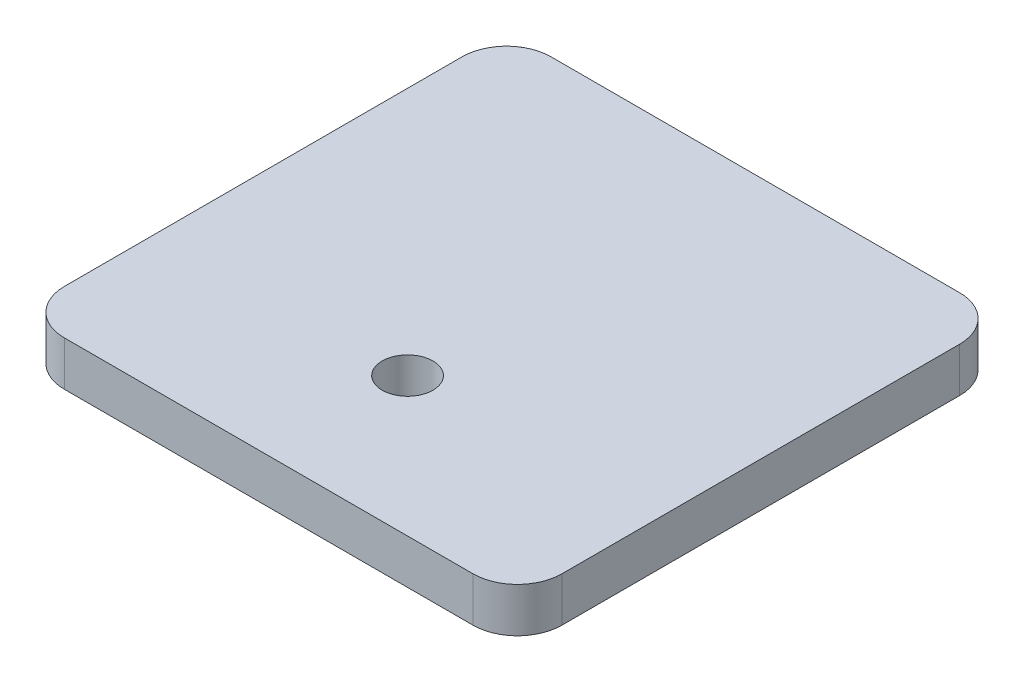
ISO-10303-21;
HEADER;
FILE_DESCRIPTION(('STEP AP214'),'2;1');
FILE_NAME('part.step','',(''),(''),'','','');
FILE_SCHEMA(('AUTOMOTIVE_DESIGN { 1 0 10303 214 1 1 1 1 }'));
ENDSEC;
DATA;
#1=APPLICATION_CONTEXT('core data for automotive mechanical design processes');
#2=APPLICATION_PROTOCOL_DEFINITION('international standard','automotive_design',2000,#1);
#3=PRODUCT_CONTEXT('',#1,'mechanical');
#4=PRODUCT('Part','Part','',(#3));
#5=PRODUCT_RELATED_PRODUCT_CATEGORY('part','',(#4));
#6=PRODUCT_DEFINITION_FORMATION('','',#4);
#7=PRODUCT_DEFINITION_CONTEXT('part definition',#1,'design');
#8=PRODUCT_DEFINITION('design','',#6,#7);
#9=PRODUCT_DEFINITION_SHAPE('','',#8);
#10=(LENGTH_UNIT() NAMED_UNIT(*) SI_UNIT(.MILLI.,.METRE.));
#11=(NAMED_UNIT(*) PLANE_ANGLE_UNIT() SI_UNIT($,.RADIAN.));
#12=(NAMED_UNIT(*) SI_UNIT($,.STERADIAN.) SOLID_ANGLE_UNIT());
#13=UNCERTAINTY_MEASURE_WITH_UNIT(LENGTH_MEASURE(1.E-05),#10,'distance_accuracy_value','');
#14=(GEOMETRIC_REPRESENTATION_CONTEXT(3) GLOBAL_UNCERTAINTY_ASSIGNED_CONTEXT((#13)) GLOBAL_UNIT_ASSIGNED_CONTEXT((#10,
#11,#12)) REPRESENTATION_CONTEXT('',''));
#15=CARTESIAN_POINT('',(0.,0.,0.));
#16=DIRECTION('',(0.,0.,1.));
#17=DIRECTION('',(1.,0.,0.));
#18=AXIS2_PLACEMENT_3D('',#15,#16,#17);
#19=CARTESIAN_POINT('',(16.2,3.,-93.9372583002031));
#20=DIRECTION('',(1.,0.,0.));
#21=DIRECTION('',(0.,0.,-1.));
#22=AXIS2_PLACEMENT_3D('',#19,#20,#21);
#23=PLANE('',#22);
#24=DIRECTION('',(0.,0.,1.));
#25=VECTOR('',#24,1.);
#26=CARTESIAN_POINT('',(16.2,3.,-93.9372583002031));
#27=LINE('',#26,#25);
#28=CARTESIAN_POINT('',(16.2,3.,-53.672155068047));
#29=VERTEX_POINT('',#28);
#30=CARTESIAN_POINT('',(16.1999999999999,3.,-16.2));
#31=VERTEX_POINT('',#30);
#32=EDGE_CURVE('E284',#29,#31,#27,.T.);
#33=ORIENTED_EDGE('',*,*,#32,.F.);
#34=DIRECTION('',(0.,-1.,0.));
#35=VECTOR('',#34,1.);
#36=CARTESIAN_POINT('',(16.2,8.2,-53.672155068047));
#37=LINE('',#36,#35);
#38=CARTESIAN_POINT('',(16.2,0.,-53.672155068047));
#39=VERTEX_POINT('',#38);
#40=EDGE_CURVE('E466',#29,#39,#37,.T.);
#41=ORIENTED_EDGE('',*,*,#40,.T.);
#42=DIRECTION('',(0.,0.,1.));
#43=VECTOR('',#42,1.);
#44=CARTESIAN_POINT('',(16.2,0.,-93.9372583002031));
#45=LINE('',#44,#43);
#46=CARTESIAN_POINT('',(16.1999999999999,0.,-16.2));
#47=VERTEX_POINT('',#46);
#48=EDGE_CURVE('E230',#39,#47,#45,.T.);
#49=ORIENTED_EDGE('',*,*,#48,.T.);
#50=DIRECTION('',(0.,-1.,0.));
#51=VECTOR('',#50,1.);
#52=CARTESIAN_POINT('',(16.1999999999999,3.,-16.2));
#53=LINE('',#52,#51);
#54=EDGE_CURVE('E311',#31,#47,#53,.T.);
#55=ORIENTED_EDGE('',*,*,#54,.F.);
#56=EDGE_LOOP('',(#33,#41,#49,#55));
#57=FACE_BOUND('',#56,.T.);
#58=ADVANCED_FACE('F17',(#57),#23,.F.);
#59=CARTESIAN_POINT('',(10.,3.,-12.3900209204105));
#60=DIRECTION('',(-1.,0.,0.));
#61=DIRECTION('',(0.,0.,1.));
#62=AXIS2_PLACEMENT_3D('',#59,#60,#61);
#63=PLANE('',#62);
#64=DIRECTION('',(0.,0.,-1.));
#65=VECTOR('',#64,1.);
#66=CARTESIAN_POINT('',(10.,3.,-12.3900209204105));
#67=LINE('',#66,#65);
#68=CARTESIAN_POINT('',(10.,3.,-58.7278449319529));
#69=VERTEX_POINT('',#68);
#70=CARTESIAN_POINT('',(10.,3.,-93.9372583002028));
#71=VERTEX_POINT('',#70);
#72=EDGE_CURVE('E271',#69,#71,#67,.T.);
#73=ORIENTED_EDGE('',*,*,#72,.F.);
#74=DIRECTION('',(0.,-1.,0.));
#75=VECTOR('',#74,1.);
#76=CARTESIAN_POINT('',(10.,8.2,-58.7278449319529));
#77=LINE('',#76,#75);
#78=CARTESIAN_POINT('',(10.,0.,-58.7278449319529));
#79=VERTEX_POINT('',#78);
#80=EDGE_CURVE('E32',#69,#79,#77,.T.);
#81=ORIENTED_EDGE('',*,*,#80,.T.);
#82=DIRECTION('',(0.,0.,-1.));
#83=VECTOR('',#82,1.);
#84=CARTESIAN_POINT('',(10.,0.,-12.3900209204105));
#85=LINE('',#84,#83);
#86=CARTESIAN_POINT('',(10.,0.,-93.9372583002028));
#87=VERTEX_POINT('',#86);
#88=EDGE_CURVE('E433',#79,#87,#85,.T.);
#89=ORIENTED_EDGE('',*,*,#88,.T.);
#90=DIRECTION('',(0.,-1.,0.));
#91=VECTOR('',#90,1.);
#92=CARTESIAN_POINT('',(10.,3.,-93.9372583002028));
#93=LINE('',#92,#91);
#94=EDGE_CURVE('E319',#71,#87,#93,.T.);
#95=ORIENTED_EDGE('',*,*,#94,.F.);
#96=EDGE_LOOP('',(#73,#81,#89,#95));
#97=FACE_BOUND('',#96,.T.);
#98=ADVANCED_FACE('F459',(#97),#63,.F.);
#99=CARTESIAN_POINT('',(100.618629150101,3.,-41.5186291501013));
#100=DIRECTION('',(0.,-1.,0.));
#101=DIRECTION('',(0.,0.,-1.));
#102=AXIS2_PLACEMENT_3D('',#99,#100,#101);
#103=PLANE('',#102);
#104=CARTESIAN_POINT('',(13.1,3.,-56.2));
#105=DIRECTION('',(0.,-1.,0.));
#106=DIRECTION('',(0.,0.,-1.));
#107=AXIS2_PLACEMENT_3D('',#104,#105,#106);
#108=CIRCLE('',#107,4.);
#109=CARTESIAN_POINT('',(10.,3.,-53.6721550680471));
#110=VERTEX_POINT('',#109);
#111=EDGE_CURVE('E11',#29,#110,#108,.T.);
#112=ORIENTED_EDGE('',*,*,#111,.F.);
#113=ORIENTED_EDGE('',*,*,#32,.T.);
#114=DIRECTION('',(1.,0.,0.));
#115=VECTOR('',#114,1.);
#116=CARTESIAN_POINT('',(16.1999999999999,3.,-16.2));
#117=LINE('',#116,#115);
#118=CARTESIAN_POINT('',(53.347155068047,3.,-16.2));
#119=VERTEX_POINT('',#118);
#120=EDGE_CURVE('E288',#31,#119,#117,.T.);
#121=ORIENTED_EDGE('',*,*,#120,.T.);
#122=CARTESIAN_POINT('',(55.875,3.,-13.1));
#123=DIRECTION('',(0.,-1.,0.));
#124=DIRECTION('',(0.,0.,-1.));
#125=AXIS2_PLACEMENT_3D('',#122,#123,#124);
#126=CIRCLE('',#125,4.00000000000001);
#127=CARTESIAN_POINT('',(53.347155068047,3.,-10.));
#128=VERTEX_POINT('',#127);
#129=EDGE_CURVE('E395',#128,#119,#126,.T.);
#130=ORIENTED_EDGE('',*,*,#129,.F.);
#131=DIRECTION('',(-1.,0.,0.));
#132=VECTOR('',#131,1.);
#133=CARTESIAN_POINT('',(99.4872583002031,3.,-10.));
#134=LINE('',#133,#132);
#135=CARTESIAN_POINT('',(12.3900209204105,3.,-10.));
#136=VERTEX_POINT('',#135);
#137=EDGE_CURVE('E264',#128,#136,#134,.T.);
#138=ORIENTED_EDGE('',*,*,#137,.T.);
#139=CARTESIAN_POINT('',(11.1950104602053,3.,-11.1950104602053));
#140=DIRECTION('',(0.,-1.,0.));
#141=DIRECTION('',(0.,0.,-1.));
#142=AXIS2_PLACEMENT_3D('',#139,#140,#141);
#143=CIRCLE('',#142,1.69);
#144=CARTESIAN_POINT('',(10.,3.,-12.3900209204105));
#145=VERTEX_POINT('',#144);
#146=EDGE_CURVE('E268',#136,#145,#143,.T.);
#147=ORIENTED_EDGE('',*,*,#146,.T.);
#148=EDGE_CURVE('E272',#145,#110,#67,.T.);
#149=ORIENTED_EDGE('',*,*,#148,.T.);
#150=EDGE_LOOP('',(#112,#113,#121,#130,#138,#147,#149));
#151=FACE_BOUND('',#150,.T.);
#152=ADVANCED_FACE('F526',(#151),#103,.T.);
#153=CARTESIAN_POINT('',(16.1999999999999,3.,-16.2));
#154=DIRECTION('',(0.,0.,-1.));
#155=DIRECTION('',(-1.,0.,0.));
#156=AXIS2_PLACEMENT_3D('',#153,#154,#155);
#157=PLANE('',#156);
#158=CARTESIAN_POINT('',(58.4028449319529,3.,-16.2));
#159=VERTEX_POINT('',#158);
#160=CARTESIAN_POINT('',(95.55,3.,-16.2));
#161=VERTEX_POINT('',#160);
#162=EDGE_CURVE('E287',#159,#161,#117,.T.);
#163=ORIENTED_EDGE('',*,*,#162,.F.);
#164=DIRECTION('',(0.,-1.,0.));
#165=VECTOR('',#164,1.);
#166=CARTESIAN_POINT('',(58.4028449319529,8.2,-16.2));
#167=LINE('',#166,#165);
#168=CARTESIAN_POINT('',(58.4028449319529,0.,-16.2));
#169=VERTEX_POINT('',#168);
#170=EDGE_CURVE('E404',#159,#169,#167,.T.);
#171=ORIENTED_EDGE('',*,*,#170,.T.);
#172=DIRECTION('',(1.,0.,0.));
#173=VECTOR('',#172,1.);
#174=CARTESIAN_POINT('',(16.1999999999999,0.,-16.2));
#175=LINE('',#174,#173);
#176=CARTESIAN_POINT('',(95.55,0.,-16.2));
#177=VERTEX_POINT('',#176);
#178=EDGE_CURVE('E237',#169,#177,#175,.T.);
#179=ORIENTED_EDGE('',*,*,#178,.T.);
#180=DIRECTION('',(0.,-1.,0.));
#181=VECTOR('',#180,1.);
#182=CARTESIAN_POINT('',(95.55,3.,-16.2));
#183=LINE('',#182,#181);
#184=EDGE_CURVE('E308',#161,#177,#183,.T.);
#185=ORIENTED_EDGE('',*,*,#184,.F.);
#186=EDGE_LOOP('',(#163,#171,#179,#185));
#187=FACE_BOUND('',#186,.T.);
#188=ADVANCED_FACE('F523',(#187),#157,.F.);
#189=CARTESIAN_POINT('',(99.4872583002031,3.,-10.));
#190=DIRECTION('',(0.,0.,1.));
#191=DIRECTION('',(1.,0.,0.));
#192=AXIS2_PLACEMENT_3D('',#189,#190,#191);
#193=PLANE('',#192);
#194=ORIENTED_EDGE('',*,*,#137,.F.);
#195=DIRECTION('',(0.,-1.,0.));
#196=VECTOR('',#195,1.);
#197=CARTESIAN_POINT('',(53.347155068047,8.2,-10.));
#198=LINE('',#197,#196);
#199=CARTESIAN_POINT('',(53.347155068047,0.,-10.));
#200=VERTEX_POINT('',#199);
#201=EDGE_CURVE('E40',#128,#200,#198,.T.);
#202=ORIENTED_EDGE('',*,*,#201,.T.);
#203=DIRECTION('',(-1.,0.,0.));
#204=VECTOR('',#203,1.);
#205=CARTESIAN_POINT('',(99.4872583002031,0.,-10.));
#206=LINE('',#205,#204);
#207=CARTESIAN_POINT('',(12.3900209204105,0.,-10.));
#208=VERTEX_POINT('',#207);
#209=EDGE_CURVE('E425',#200,#208,#206,.T.);
#210=ORIENTED_EDGE('',*,*,#209,.T.);
#211=DIRECTION('',(0.,-1.,0.));
#212=VECTOR('',#211,1.);
#213=CARTESIAN_POINT('',(12.3900209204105,3.,-10.));
#214=LINE('',#213,#212);
#215=EDGE_CURVE('E324',#136,#208,#214,.T.);
#216=ORIENTED_EDGE('',*,*,#215,.F.);
#217=EDGE_LOOP('',(#194,#202,#210,#216));
#218=FACE_BOUND('',#217,.T.);
#219=ADVANCED_FACE('F525',(#218),#193,.F.);
#220=CARTESIAN_POINT('',(58.4028449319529,3.,-10.));
#221=VERTEX_POINT('',#220);
#222=EDGE_CURVE('E396',#159,#221,#126,.T.);
#223=ORIENTED_EDGE('',*,*,#222,.F.);
#224=ORIENTED_EDGE('',*,*,#162,.T.);
#225=DIRECTION('',(0.,0.,-1.));
#226=VECTOR('',#225,1.);
#227=CARTESIAN_POINT('',(95.55,3.,-16.2));
#228=LINE('',#227,#226);
#229=CARTESIAN_POINT('',(95.55,3.,-40.387258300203));
#230=VERTEX_POINT('',#229);
#231=EDGE_CURVE('E291',#161,#230,#228,.T.);
#232=ORIENTED_EDGE('',*,*,#231,.T.);
#233=CARTESIAN_POINT('',(96.6813708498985,3.,-41.5186291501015));
#234=DIRECTION('',(0.,-1.,0.));
#235=DIRECTION('',(0.,0.,1.));
#236=AXIS2_PLACEMENT_3D('',#233,#234,#235);
#237=CIRCLE('',#236,1.60000000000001);
#238=CARTESIAN_POINT('',(97.812741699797,3.,-42.65));
#239=VERTEX_POINT('',#238);
#240=EDGE_CURVE('E294',#230,#239,#237,.T.);
#241=ORIENTED_EDGE('',*,*,#240,.T.);
#242=DIRECTION('',(1.,0.,0.));
#243=VECTOR('',#242,1.);
#244=CARTESIAN_POINT('',(97.812741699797,3.,-42.65));
#245=LINE('',#244,#243);
#246=CARTESIAN_POINT('',(99.487258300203,3.,-42.65));
#247=VERTEX_POINT('',#246);
#248=EDGE_CURVE('E297',#239,#247,#245,.T.);
#249=ORIENTED_EDGE('',*,*,#248,.T.);
#250=CARTESIAN_POINT('',(100.618629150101,3.,-41.5186291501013));
#251=DIRECTION('',(0.,-1.,0.));
#252=DIRECTION('',(0.,0.,-1.));
#253=AXIS2_PLACEMENT_3D('',#250,#251,#252);
#254=CIRCLE('',#253,1.60000000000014);
#255=CARTESIAN_POINT('',(101.75,3.,-40.3872583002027));
#256=VERTEX_POINT('',#255);
#257=EDGE_CURVE('E255',#247,#256,#254,.T.);
#258=ORIENTED_EDGE('',*,*,#257,.T.);
#259=DIRECTION('',(0.,0.,1.));
#260=VECTOR('',#259,1.);
#261=CARTESIAN_POINT('',(101.75,3.,-40.3872583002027));
#262=LINE('',#261,#260);
#263=CARTESIAN_POINT('',(101.75,3.,-12.2627416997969));
#264=VERTEX_POINT('',#263);
#265=EDGE_CURVE('E258',#256,#264,#262,.T.);
#266=ORIENTED_EDGE('',*,*,#265,.T.);
#267=CARTESIAN_POINT('',(100.618629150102,3.,-11.1313708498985));
#268=DIRECTION('',(0.,-1.,0.));
#269=DIRECTION('',(0.,0.,-1.));
#270=AXIS2_PLACEMENT_3D('',#267,#268,#269);
#271=CIRCLE('',#270,1.59999999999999);
#272=CARTESIAN_POINT('',(99.4872583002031,3.,-10.));
#273=VERTEX_POINT('',#272);
#274=EDGE_CURVE('E261',#264,#273,#271,.T.);
#275=ORIENTED_EDGE('',*,*,#274,.T.);
#276=EDGE_CURVE('E265',#273,#221,#134,.T.);
#277=ORIENTED_EDGE('',*,*,#276,.T.);
#278=EDGE_LOOP('',(#223,#224,#232,#241,#249,#258,#266,#275,#277));
#279=FACE_BOUND('',#278,.T.);
#280=ADVANCED_FACE('F415',(#279),#103,.T.);
#281=CARTESIAN_POINT('',(101.75,10.,-10.));
#282=DIRECTION('',(0.,1.,0.));
#283=DIRECTION('',(0.,0.,1.));
#284=AXIS2_PLACEMENT_3D('',#281,#282,#283);
#285=PLANE('',#284);
#286=CARTESIAN_POINT('',(101.75,10.,-10.));
#287=DIRECTION('',(0.,1.,0.));
#288=DIRECTION('',(0.,0.,1.));
#289=AXIS2_PLACEMENT_3D('',#286,#287,#288);
#290=CIRCLE('',#289,10.);
#291=CARTESIAN_POINT('',(101.75,10.,0.));
#292=VERTEX_POINT('',#291);
#293=CARTESIAN_POINT('',(111.75,10.,-10.0000000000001));
#294=VERTEX_POINT('',#293);
#295=EDGE_CURVE('E355',#292,#294,#290,.T.);
#296=ORIENTED_EDGE('',*,*,#295,.T.);
#297=DIRECTION('',(0.,0.,-1.));
#298=VECTOR('',#297,1.);
#299=CARTESIAN_POINT('',(111.75,10.,-10.0000000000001));
#300=LINE('',#299,#298);
#301=CARTESIAN_POINT('',(111.75,10.,-99.2999999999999));
#302=VERTEX_POINT('',#301);
#303=EDGE_CURVE('E358',#294,#302,#300,.T.);
#304=ORIENTED_EDGE('',*,*,#303,.T.);
#305=CARTESIAN_POINT('',(101.75,10.,-99.3));
#306=DIRECTION('',(0.,1.,0.));
#307=DIRECTION('',(0.,0.,-1.));
#308=AXIS2_PLACEMENT_3D('',#305,#306,#307);
#309=CIRCLE('',#308,9.99999999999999);
#310=CARTESIAN_POINT('',(101.75,10.,-109.3));
#311=VERTEX_POINT('',#310);
#312=EDGE_CURVE('E360',#302,#311,#309,.T.);
#313=ORIENTED_EDGE('',*,*,#312,.T.);
#314=DIRECTION('',(-1.,0.,0.));
#315=VECTOR('',#314,1.);
#316=CARTESIAN_POINT('',(10.0000000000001,10.,-109.3));
#317=LINE('',#316,#315);
#318=CARTESIAN_POINT('',(10.0000000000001,10.,-109.3));
#319=VERTEX_POINT('',#318);
#320=EDGE_CURVE('E362',#311,#319,#317,.T.);
#321=ORIENTED_EDGE('',*,*,#320,.T.);
#322=CARTESIAN_POINT('',(10.,10.,-99.3));
#323=DIRECTION('',(0.,1.,0.));
#324=DIRECTION('',(0.,0.,-1.));
#325=AXIS2_PLACEMENT_3D('',#322,#323,#324);
#326=CIRCLE('',#325,10.);
#327=CARTESIAN_POINT('',(0.,10.,-99.2999999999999));
#328=VERTEX_POINT('',#327);
#329=EDGE_CURVE('E364',#319,#328,#326,.T.);
#330=ORIENTED_EDGE('',*,*,#329,.T.);
#331=DIRECTION('',(0.,0.,1.));
#332=VECTOR('',#331,1.);
#333=CARTESIAN_POINT('',(0.,10.,-10.0000000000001));
#334=LINE('',#333,#332);
#335=CARTESIAN_POINT('',(0.,10.,-10.0000000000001));
#336=VERTEX_POINT('',#335);
#337=EDGE_CURVE('E366',#328,#336,#334,.T.);
#338=ORIENTED_EDGE('',*,*,#337,.T.);
#339=CARTESIAN_POINT('',(10.,10.,-10.));
#340=DIRECTION('',(0.,1.,0.));
#341=DIRECTION('',(0.,0.,-1.));
#342=AXIS2_PLACEMENT_3D('',#339,#340,#341);
#343=CIRCLE('',#342,10.);
#344=CARTESIAN_POINT('',(10.0000000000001,10.,0.));
#345=VERTEX_POINT('',#344);
#346=EDGE_CURVE('E368',#336,#345,#343,.T.);
#347=ORIENTED_EDGE('',*,*,#346,.T.);
#348=DIRECTION('',(1.,0.,0.));
#349=VECTOR('',#348,1.);
#350=CARTESIAN_POINT('',(10.0000000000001,10.,0.));
#351=LINE('',#350,#349);
#352=EDGE_CURVE('E370',#345,#292,#351,.T.);
#353=ORIENTED_EDGE('',*,*,#352,.T.);
#354=EDGE_LOOP('',(#296,#304,#313,#321,#330,#338,#347,#353));
#355=FACE_BOUND('',#354,.T.);
#356=CARTESIAN_POINT('',(55.875,10.,-31.2));
#357=DIRECTION('',(0.,1.,0.));
#358=DIRECTION('',(0.,0.,1.));
#359=AXIS2_PLACEMENT_3D('',#356,#357,#358);
#360=CIRCLE('',#359,5.70000000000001);
#361=CARTESIAN_POINT('',(55.875,10.,-25.5));
#362=VERTEX_POINT('',#361);
#363=EDGE_CURVE('E335',#362,#362,#360,.T.);
#364=ORIENTED_EDGE('',*,*,#363,.F.);
#365=EDGE_LOOP('',(#364));
#366=FACE_BOUND('',#365,.T.);
#367=ADVANCED_FACE('F588',(#355,#366),#285,.T.);
#368=CARTESIAN_POINT('',(101.75,0.,-10.));
#369=DIRECTION('',(0.,1.,0.));
#370=DIRECTION('',(0.,0.,1.));
#371=AXIS2_PLACEMENT_3D('',#368,#369,#370);
#372=PLANE('',#371);
#373=CARTESIAN_POINT('',(66.9386396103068,0.,-82.7439628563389));
#374=DIRECTION('',(0.,-1.,0.));
#375=DIRECTION('',(0.,0.,1.));
#376=AXIS2_PLACEMENT_3D('',#373,#374,#375);
#377=CIRCLE('',#376,1.1);
#378=CARTESIAN_POINT('',(66.9386396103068,0.,-81.6439628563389));
#379=VERTEX_POINT('',#378);
#380=EDGE_CURVE('E476',#379,#379,#377,.T.);
#381=ORIENTED_EDGE('',*,*,#380,.F.);
#382=EDGE_LOOP('',(#381));
#383=FACE_BOUND('',#382,.T.);
#384=CARTESIAN_POINT('',(44.9386396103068,0.,-82.7439628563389));
#385=DIRECTION('',(0.,-1.,0.));
#386=DIRECTION('',(0.,0.,-1.));
#387=AXIS2_PLACEMENT_3D('',#384,#385,#386);
#388=CIRCLE('',#387,1.1);
#389=CARTESIAN_POINT('',(44.9386396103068,0.,-83.8439628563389));
#390=VERTEX_POINT('',#389);
#391=EDGE_CURVE('E482',#390,#390,#388,.T.);
#392=ORIENTED_EDGE('',*,*,#391,.F.);
#393=EDGE_LOOP('',(#392));
#394=FACE_BOUND('',#393,.T.);
#395=CARTESIAN_POINT('',(44.9386396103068,0.,-36.7439628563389));
#396=DIRECTION('',(0.,-1.,0.));
#397=DIRECTION('',(0.,0.,1.));
#398=AXIS2_PLACEMENT_3D('',#395,#396,#397);
#399=CIRCLE('',#398,1.10000000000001);
#400=CARTESIAN_POINT('',(44.9386396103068,0.,-35.6439628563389));
#401=VERTEX_POINT('',#400);
#402=EDGE_CURVE('E488',#401,#401,#399,.T.);
#403=ORIENTED_EDGE('',*,*,#402,.F.);
#404=EDGE_LOOP('',(#403));
#405=FACE_BOUND('',#404,.T.);
#406=CARTESIAN_POINT('',(66.9386396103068,0.,-36.7439628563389));
#407=DIRECTION('',(0.,-1.,0.));
#408=DIRECTION('',(0.,0.,-1.));
#409=AXIS2_PLACEMENT_3D('',#406,#407,#408);
#410=CIRCLE('',#409,1.10000000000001);
#411=CARTESIAN_POINT('',(66.9386396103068,0.,-37.8439628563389));
#412=VERTEX_POINT('',#411);
#413=EDGE_CURVE('E494',#412,#412,#410,.T.);
#414=ORIENTED_EDGE('',*,*,#413,.F.);
#415=EDGE_LOOP('',(#414));
#416=FACE_BOUND('',#415,.T.);
#417=ORIENTED_EDGE('',*,*,#48,.F.);
#418=CARTESIAN_POINT('',(13.1,0.,-56.2));
#419=DIRECTION('',(0.,-1.,0.));
#420=DIRECTION('',(0.,0.,-1.));
#421=AXIS2_PLACEMENT_3D('',#418,#419,#420);
#422=CIRCLE('',#421,4.);
#423=CARTESIAN_POINT('',(16.2,0.,-58.727844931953));
#424=VERTEX_POINT('',#423);
#425=EDGE_CURVE('E214',#424,#39,#422,.T.);
#426=ORIENTED_EDGE('',*,*,#425,.F.);
#427=CARTESIAN_POINT('',(16.2,0.,-93.9372583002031));
#428=VERTEX_POINT('',#427);
#429=EDGE_CURVE('E228',#428,#424,#45,.T.);
#430=ORIENTED_EDGE('',*,*,#429,.F.);
#431=CARTESIAN_POINT('',(15.0686291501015,0.,-95.0686291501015));
#432=DIRECTION('',(0.,-1.,0.));
#433=DIRECTION('',(0.,0.,1.));
#434=AXIS2_PLACEMENT_3D('',#431,#432,#433);
#435=CIRCLE('',#434,1.6);
#436=CARTESIAN_POINT('',(13.937258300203,0.,-96.2));
#437=VERTEX_POINT('',#436);
#438=EDGE_CURVE('E241',#437,#428,#435,.T.);
#439=ORIENTED_EDGE('',*,*,#438,.F.);
#440=DIRECTION('',(1.,0.,0.));
#441=VECTOR('',#440,1.);
#442=CARTESIAN_POINT('',(12.2627416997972,0.,-96.2));
#443=LINE('',#442,#441);
#444=CARTESIAN_POINT('',(12.2627416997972,0.,-96.2));
#445=VERTEX_POINT('',#444);
#446=EDGE_CURVE('E442',#445,#437,#443,.T.);
#447=ORIENTED_EDGE('',*,*,#446,.F.);
#448=CARTESIAN_POINT('',(11.1313708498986,0.,-95.0686291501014));
#449=DIRECTION('',(0.,-1.,0.));
#450=DIRECTION('',(0.,0.,-1.));
#451=AXIS2_PLACEMENT_3D('',#448,#449,#450);
#452=CIRCLE('',#451,1.60000000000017);
#453=EDGE_CURVE('E440',#87,#445,#452,.T.);
#454=ORIENTED_EDGE('',*,*,#453,.F.);
#455=ORIENTED_EDGE('',*,*,#88,.F.);
#456=CARTESIAN_POINT('',(10.,0.,-53.6721550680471));
#457=VERTEX_POINT('',#456);
#458=EDGE_CURVE('E232',#457,#79,#422,.T.);
#459=ORIENTED_EDGE('',*,*,#458,.F.);
#460=CARTESIAN_POINT('',(10.,0.,-12.3900209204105));
#461=VERTEX_POINT('',#460);
#462=EDGE_CURVE('E437',#461,#457,#85,.T.);
#463=ORIENTED_EDGE('',*,*,#462,.F.);
#464=CARTESIAN_POINT('',(11.1950104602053,0.,-11.1950104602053));
#465=DIRECTION('',(0.,-1.,0.));
#466=DIRECTION('',(0.,0.,-1.));
#467=AXIS2_PLACEMENT_3D('',#464,#465,#466);
#468=CIRCLE('',#467,1.69);
#469=EDGE_CURVE('E430',#208,#461,#468,.T.);
#470=ORIENTED_EDGE('',*,*,#469,.F.);
#471=ORIENTED_EDGE('',*,*,#209,.F.);
#472=CARTESIAN_POINT('',(55.875,0.,-13.1));
#473=DIRECTION('',(0.,-1.,0.));
#474=DIRECTION('',(0.,0.,-1.));
#475=AXIS2_PLACEMENT_3D('',#472,#473,#474);
#476=CIRCLE('',#475,4.00000000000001);
#477=CARTESIAN_POINT('',(58.4028449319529,0.,-10.));
#478=VERTEX_POINT('',#477);
#479=EDGE_CURVE('E429',#478,#200,#476,.T.);
#480=ORIENTED_EDGE('',*,*,#479,.F.);
#481=CARTESIAN_POINT('',(99.4872583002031,0.,-10.));
#482=VERTEX_POINT('',#481);
#483=EDGE_CURVE('E412',#482,#478,#206,.T.);
#484=ORIENTED_EDGE('',*,*,#483,.F.);
#485=CARTESIAN_POINT('',(100.618629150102,0.,-11.1313708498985));
#486=DIRECTION('',(0.,-1.,0.));
#487=DIRECTION('',(0.,0.,-1.));
#488=AXIS2_PLACEMENT_3D('',#485,#486,#487);
#489=CIRCLE('',#488,1.59999999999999);
#490=CARTESIAN_POINT('',(101.75,0.,-12.2627416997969));
#491=VERTEX_POINT('',#490);
#492=EDGE_CURVE('E423',#491,#482,#489,.T.);
#493=ORIENTED_EDGE('',*,*,#492,.F.);
#494=DIRECTION('',(0.,0.,1.));
#495=VECTOR('',#494,1.);
#496=CARTESIAN_POINT('',(101.75,0.,-40.3872583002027));
#497=LINE('',#496,#495);
#498=CARTESIAN_POINT('',(101.75,0.,-40.3872583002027));
#499=VERTEX_POINT('',#498);
#500=EDGE_CURVE('E426',#499,#491,#497,.T.);
#501=ORIENTED_EDGE('',*,*,#500,.F.);
#502=CARTESIAN_POINT('',(100.618629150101,0.,-41.5186291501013));
#503=DIRECTION('',(0.,-1.,0.));
#504=DIRECTION('',(0.,0.,-1.));
#505=AXIS2_PLACEMENT_3D('',#502,#503,#504);
#506=CIRCLE('',#505,1.60000000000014);
#507=CARTESIAN_POINT('',(99.487258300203,0.,-42.65));
#508=VERTEX_POINT('',#507);
#509=EDGE_CURVE('E500',#508,#499,#506,.T.);
#510=ORIENTED_EDGE('',*,*,#509,.F.);
#511=DIRECTION('',(1.,0.,0.));
#512=VECTOR('',#511,1.);
#513=CARTESIAN_POINT('',(97.812741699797,0.,-42.65));
#514=LINE('',#513,#512);
#515=CARTESIAN_POINT('',(97.812741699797,0.,-42.65));
#516=VERTEX_POINT('',#515);
#517=EDGE_CURVE('E252',#516,#508,#514,.T.);
#518=ORIENTED_EDGE('',*,*,#517,.F.);
#519=CARTESIAN_POINT('',(96.6813708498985,0.,-41.5186291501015));
#520=DIRECTION('',(0.,-1.,0.));
#521=DIRECTION('',(0.,0.,1.));
#522=AXIS2_PLACEMENT_3D('',#519,#520,#521);
#523=CIRCLE('',#522,1.60000000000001);
#524=CARTESIAN_POINT('',(95.55,0.,-40.387258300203));
#525=VERTEX_POINT('',#524);
#526=EDGE_CURVE('E249',#525,#516,#523,.T.);
#527=ORIENTED_EDGE('',*,*,#526,.F.);
#528=DIRECTION('',(0.,0.,-1.));
#529=VECTOR('',#528,1.);
#530=CARTESIAN_POINT('',(95.55,0.,-16.2));
#531=LINE('',#530,#529);
#532=EDGE_CURVE('E246',#177,#525,#531,.T.);
#533=ORIENTED_EDGE('',*,*,#532,.F.);
#534=ORIENTED_EDGE('',*,*,#178,.F.);
#535=CARTESIAN_POINT('',(53.347155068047,0.,-16.2));
#536=VERTEX_POINT('',#535);
#537=EDGE_CURVE('E468',#536,#169,#476,.T.);
#538=ORIENTED_EDGE('',*,*,#537,.F.);
#539=EDGE_CURVE('E239',#47,#536,#175,.T.);
#540=ORIENTED_EDGE('',*,*,#539,.F.);
#541=EDGE_LOOP('',(#417,#426,#430,#439,#447,#454,#455,#459,#463,#470,#471,#480,#484,#493,#501,
#510,#518,#527,#533,#534,#538,#540));
#542=FACE_BOUND('',#541,.T.);
#543=CARTESIAN_POINT('',(101.75,0.,-10.));
#544=DIRECTION('',(0.,1.,0.));
#545=DIRECTION('',(0.,0.,1.));
#546=AXIS2_PLACEMENT_3D('',#543,#544,#545);
#547=CIRCLE('',#546,10.);
#548=CARTESIAN_POINT('',(101.75,0.,0.));
#549=VERTEX_POINT('',#548);
#550=CARTESIAN_POINT('',(111.75,0.,-10.0000000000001));
#551=VERTEX_POINT('',#550);
#552=EDGE_CURVE('E338',#549,#551,#547,.T.);
#553=ORIENTED_EDGE('',*,*,#552,.F.);
#554=DIRECTION('',(1.,0.,0.));
#555=VECTOR('',#554,1.);
#556=CARTESIAN_POINT('',(10.0000000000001,0.,0.));
#557=LINE('',#556,#555);
#558=CARTESIAN_POINT('',(10.0000000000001,0.,0.));
#559=VERTEX_POINT('',#558);
#560=EDGE_CURVE('E353',#559,#549,#557,.T.);
#561=ORIENTED_EDGE('',*,*,#560,.F.);
#562=CARTESIAN_POINT('',(10.,0.,-10.));
#563=DIRECTION('',(0.,1.,0.));
#564=DIRECTION('',(0.,0.,-1.));
#565=AXIS2_PLACEMENT_3D('',#562,#563,#564);
#566=CIRCLE('',#565,10.);
#567=CARTESIAN_POINT('',(0.,0.,-10.0000000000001));
#568=VERTEX_POINT('',#567);
#569=EDGE_CURVE('E351',#568,#559,#566,.T.);
#570=ORIENTED_EDGE('',*,*,#569,.F.);
#571=DIRECTION('',(0.,0.,1.));
#572=VECTOR('',#571,1.);
#573=CARTESIAN_POINT('',(0.,0.,-10.0000000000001));
#574=LINE('',#573,#572);
#575=CARTESIAN_POINT('',(0.,0.,-99.2999999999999));
#576=VERTEX_POINT('',#575);
#577=EDGE_CURVE('E349',#576,#568,#574,.T.);
#578=ORIENTED_EDGE('',*,*,#577,.F.);
#579=CARTESIAN_POINT('',(10.,0.,-99.3));
#580=DIRECTION('',(0.,1.,0.));
#581=DIRECTION('',(0.,0.,-1.));
#582=AXIS2_PLACEMENT_3D('',#579,#580,#581);
#583=CIRCLE('',#582,10.);
#584=CARTESIAN_POINT('',(10.0000000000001,0.,-109.3));
#585=VERTEX_POINT('',#584);
#586=EDGE_CURVE('E347',#585,#576,#583,.T.);
#587=ORIENTED_EDGE('',*,*,#586,.F.);
#588=DIRECTION('',(-1.,0.,0.));
#589=VECTOR('',#588,1.);
#590=CARTESIAN_POINT('',(10.0000000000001,0.,-109.3));
#591=LINE('',#590,#589);
#592=CARTESIAN_POINT('',(101.75,0.,-109.3));
#593=VERTEX_POINT('',#592);
#594=EDGE_CURVE('E345',#593,#585,#591,.T.);
#595=ORIENTED_EDGE('',*,*,#594,.F.);
#596=CARTESIAN_POINT('',(101.75,0.,-99.3));
#597=DIRECTION('',(0.,1.,0.));
#598=DIRECTION('',(0.,0.,-1.));
#599=AXIS2_PLACEMENT_3D('',#596,#597,#598);
#600=CIRCLE('',#599,9.99999999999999);
#601=CARTESIAN_POINT('',(111.75,0.,-99.2999999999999));
#602=VERTEX_POINT('',#601);
#603=EDGE_CURVE('E343',#602,#593,#600,.T.);
#604=ORIENTED_EDGE('',*,*,#603,.F.);
#605=DIRECTION('',(0.,0.,-1.));
#606=VECTOR('',#605,1.);
#607=CARTESIAN_POINT('',(111.75,0.,-10.0000000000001));
#608=LINE('',#607,#606);
#609=EDGE_CURVE('E341',#551,#602,#608,.T.);
#610=ORIENTED_EDGE('',*,*,#609,.F.);
#611=EDGE_LOOP('',(#553,#561,#570,#578,#587,#595,#604,#610));
#612=FACE_BOUND('',#611,.T.);
#613=CARTESIAN_POINT('',(55.875,0.,-31.2));
#614=DIRECTION('',(0.,1.,0.));
#615=DIRECTION('',(0.,0.,1.));
#616=AXIS2_PLACEMENT_3D('',#613,#614,#615);
#617=CIRCLE('',#616,5.70000000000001);
#618=CARTESIAN_POINT('',(55.875,0.,-25.5));
#619=VERTEX_POINT('',#618);
#620=EDGE_CURVE('E303',#619,#619,#617,.T.);
#621=ORIENTED_EDGE('',*,*,#620,.T.);
#622=EDGE_LOOP('',(#621));
#623=FACE_BOUND('',#622,.T.);
#624=ADVANCED_FACE('F225',(#383,#394,#405,#416,#542,#612,#623),#372,.F.);
#625=CARTESIAN_POINT('',(101.75,10.,-10.));
#626=DIRECTION('',(0.,-1.,0.));
#627=DIRECTION('',(0.,0.,-1.));
#628=AXIS2_PLACEMENT_3D('',#625,#626,#627);
#629=CYLINDRICAL_SURFACE('',#628,10.);
#630=ORIENTED_EDGE('',*,*,#552,.T.);
#631=DIRECTION('',(0.,-1.,0.));
#632=VECTOR('',#631,1.);
#633=CARTESIAN_POINT('',(111.75,10.,-10.0000000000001));
#634=LINE('',#633,#632);
#635=EDGE_CURVE('E393',#294,#551,#634,.T.);
#636=ORIENTED_EDGE('',*,*,#635,.F.);
#637=ORIENTED_EDGE('',*,*,#295,.F.);
#638=DIRECTION('',(0.,-1.,0.));
#639=VECTOR('',#638,1.);
#640=CARTESIAN_POINT('',(101.75,10.,0.));
#641=LINE('',#640,#639);
#642=EDGE_CURVE('E372',#292,#549,#641,.T.);
#643=ORIENTED_EDGE('',*,*,#642,.T.);
#644=EDGE_LOOP('',(#630,#636,#637,#643));
#645=FACE_BOUND('',#644,.T.);
#646=ADVANCED_FACE('F19',(#645),#629,.T.);
#647=CARTESIAN_POINT('',(111.75,10.,-10.0000000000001));
#648=DIRECTION('',(-1.,0.,0.));
#649=DIRECTION('',(0.,0.,1.));
#650=AXIS2_PLACEMENT_3D('',#647,#648,#649);
#651=PLANE('',#650);
#652=ORIENTED_EDGE('',*,*,#609,.T.);
#653=DIRECTION('',(0.,-1.,0.));
#654=VECTOR('',#653,1.);
#655=CARTESIAN_POINT('',(111.75,10.,-99.2999999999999));
#656=LINE('',#655,#654);
#657=EDGE_CURVE('E390',#302,#602,#656,.T.);
#658=ORIENTED_EDGE('',*,*,#657,.F.);
#659=ORIENTED_EDGE('',*,*,#303,.F.);
#660=ORIENTED_EDGE('',*,*,#635,.T.);
#661=EDGE_LOOP('',(#652,#658,#659,#660));
#662=FACE_BOUND('',#661,.T.);
#663=ADVANCED_FACE('F614',(#662),#651,.F.);
#664=CARTESIAN_POINT('',(101.75,10.,-99.3));
#665=DIRECTION('',(0.,-1.,0.));
#666=DIRECTION('',(0.,0.,-1.));
#667=AXIS2_PLACEMENT_3D('',#664,#665,#666);
#668=CYLINDRICAL_SURFACE('',#667,9.99999999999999);
#669=ORIENTED_EDGE('',*,*,#603,.T.);
#670=DIRECTION('',(0.,-1.,0.));
#671=VECTOR('',#670,1.);
#672=CARTESIAN_POINT('',(101.75,10.,-109.3));
#673=LINE('',#672,#671);
#674=EDGE_CURVE('E387',#311,#593,#673,.T.);
#675=ORIENTED_EDGE('',*,*,#674,.F.);
#676=ORIENTED_EDGE('',*,*,#312,.F.);
#677=ORIENTED_EDGE('',*,*,#657,.T.);
#678=EDGE_LOOP('',(#669,#675,#676,#677));
#679=FACE_BOUND('',#678,.T.);
#680=ADVANCED_FACE('F611',(#679),#668,.T.);
#681=CARTESIAN_POINT('',(10.0000000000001,10.,-109.3));
#682=DIRECTION('',(0.,0.,1.));
#683=DIRECTION('',(1.,0.,0.));
#684=AXIS2_PLACEMENT_3D('',#681,#682,#683);
#685=PLANE('',#684);
#686=ORIENTED_EDGE('',*,*,#594,.T.);
#687=DIRECTION('',(0.,-1.,0.));
#688=VECTOR('',#687,1.);
#689=CARTESIAN_POINT('',(10.0000000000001,10.,-109.3));
#690=LINE('',#689,#688);
#691=EDGE_CURVE('E384',#319,#585,#690,.T.);
#692=ORIENTED_EDGE('',*,*,#691,.F.);
#693=ORIENTED_EDGE('',*,*,#320,.F.);
#694=ORIENTED_EDGE('',*,*,#674,.T.);
#695=EDGE_LOOP('',(#686,#692,#693,#694));
#696=FACE_BOUND('',#695,.T.);
#697=ADVANCED_FACE('F607',(#696),#685,.F.);
#698=CARTESIAN_POINT('',(10.,10.,-99.3));
#699=DIRECTION('',(0.,-1.,0.));
#700=DIRECTION('',(0.,0.,-1.));
#701=AXIS2_PLACEMENT_3D('',#698,#699,#700);
#702=CYLINDRICAL_SURFACE('',#701,10.);
#703=ORIENTED_EDGE('',*,*,#586,.T.);
#704=DIRECTION('',(0.,-1.,0.));
#705=VECTOR('',#704,1.);
#706=CARTESIAN_POINT('',(0.,10.,-99.2999999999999));
#707=LINE('',#706,#705);
#708=EDGE_CURVE('E381',#328,#576,#707,.T.);
#709=ORIENTED_EDGE('',*,*,#708,.F.);
#710=ORIENTED_EDGE('',*,*,#329,.F.);
#711=ORIENTED_EDGE('',*,*,#691,.T.);
#712=EDGE_LOOP('',(#703,#709,#710,#711));
#713=FACE_BOUND('',#712,.T.);
#714=ADVANCED_FACE('F603',(#713),#702,.T.);
#715=CARTESIAN_POINT('',(0.,10.,-10.0000000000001));
#716=DIRECTION('',(1.,0.,0.));
#717=DIRECTION('',(0.,0.,-1.));
#718=AXIS2_PLACEMENT_3D('',#715,#716,#717);
#719=PLANE('',#718);
#720=ORIENTED_EDGE('',*,*,#577,.T.);
#721=DIRECTION('',(0.,-1.,0.));
#722=VECTOR('',#721,1.);
#723=CARTESIAN_POINT('',(0.,10.,-10.0000000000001));
#724=LINE('',#723,#722);
#725=EDGE_CURVE('E378',#336,#568,#724,.T.);
#726=ORIENTED_EDGE('',*,*,#725,.F.);
#727=ORIENTED_EDGE('',*,*,#337,.F.);
#728=ORIENTED_EDGE('',*,*,#708,.T.);
#729=EDGE_LOOP('',(#720,#726,#727,#728));
#730=FACE_BOUND('',#729,.T.);
#731=ADVANCED_FACE('F599',(#730),#719,.F.);
#732=CARTESIAN_POINT('',(10.,10.,-10.));
#733=DIRECTION('',(0.,-1.,0.));
#734=DIRECTION('',(0.,0.,-1.));
#735=AXIS2_PLACEMENT_3D('',#732,#733,#734);
#736=CYLINDRICAL_SURFACE('',#735,10.);
#737=ORIENTED_EDGE('',*,*,#569,.T.);
#738=DIRECTION('',(0.,-1.,0.));
#739=VECTOR('',#738,1.);
#740=CARTESIAN_POINT('',(10.0000000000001,10.,0.));
#741=LINE('',#740,#739);
#742=EDGE_CURVE('E375',#345,#559,#741,.T.);
#743=ORIENTED_EDGE('',*,*,#742,.F.);
#744=ORIENTED_EDGE('',*,*,#346,.F.);
#745=ORIENTED_EDGE('',*,*,#725,.T.);
#746=EDGE_LOOP('',(#737,#743,#744,#745));
#747=FACE_BOUND('',#746,.T.);
#748=ADVANCED_FACE('F595',(#747),#736,.T.);
#749=CARTESIAN_POINT('',(10.0000000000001,10.,0.));
#750=DIRECTION('',(0.,0.,-1.));
#751=DIRECTION('',(-1.,0.,0.));
#752=AXIS2_PLACEMENT_3D('',#749,#750,#751);
#753=PLANE('',#752);
#754=ORIENTED_EDGE('',*,*,#560,.T.);
#755=ORIENTED_EDGE('',*,*,#642,.F.);
#756=ORIENTED_EDGE('',*,*,#352,.F.);
#757=ORIENTED_EDGE('',*,*,#742,.T.);
#758=EDGE_LOOP('',(#754,#755,#756,#757));
#759=FACE_BOUND('',#758,.T.);
#760=ADVANCED_FACE('F584',(#759),#753,.F.);
#761=CARTESIAN_POINT('',(55.875,10.,-31.2));
#762=DIRECTION('',(0.,-1.,0.));
#763=DIRECTION('',(0.,0.,-1.));
#764=AXIS2_PLACEMENT_3D('',#761,#762,#763);
#765=CYLINDRICAL_SURFACE('',#764,5.70000000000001);
#766=ORIENTED_EDGE('',*,*,#363,.T.);
#767=EDGE_LOOP('',(#766));
#768=FACE_BOUND('',#767,.T.);
#769=ORIENTED_EDGE('',*,*,#620,.F.);
#770=EDGE_LOOP('',(#769));
#771=FACE_BOUND('',#770,.T.);
#772=ADVANCED_FACE('F581',(#768,#771),#765,.F.);
#773=CARTESIAN_POINT('',(100.618629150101,3.,-41.5186291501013));
#774=DIRECTION('',(0.,-1.,0.));
#775=DIRECTION('',(0.,0.,-1.));
#776=AXIS2_PLACEMENT_3D('',#773,#774,#775);
#777=CYLINDRICAL_SURFACE('',#776,1.60000000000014);
#778=ORIENTED_EDGE('',*,*,#509,.T.);
#779=DIRECTION('',(0.,-1.,0.));
#780=VECTOR('',#779,1.);
#781=CARTESIAN_POINT('',(101.75,3.,-40.3872583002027));
#782=LINE('',#781,#780);
#783=EDGE_CURVE('E300',#256,#499,#782,.T.);
#784=ORIENTED_EDGE('',*,*,#783,.F.);
#785=ORIENTED_EDGE('',*,*,#257,.F.);
#786=DIRECTION('',(0.,-1.,0.));
#787=VECTOR('',#786,1.);
#788=CARTESIAN_POINT('',(99.487258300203,3.,-42.65));
#789=LINE('',#788,#787);
#790=EDGE_CURVE('E301',#247,#508,#789,.T.);
#791=ORIENTED_EDGE('',*,*,#790,.T.);
#792=EDGE_LOOP('',(#778,#784,#785,#791));
#793=FACE_BOUND('',#792,.T.);
#794=ADVANCED_FACE('F507',(#793),#777,.F.);
#795=CARTESIAN_POINT('',(97.812741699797,3.,-42.65));
#796=DIRECTION('',(0.,0.,-1.));
#797=DIRECTION('',(-1.,0.,0.));
#798=AXIS2_PLACEMENT_3D('',#795,#796,#797);
#799=PLANE('',#798);
#800=ORIENTED_EDGE('',*,*,#517,.T.);
#801=ORIENTED_EDGE('',*,*,#790,.F.);
#802=ORIENTED_EDGE('',*,*,#248,.F.);
#803=DIRECTION('',(0.,-1.,0.));
#804=VECTOR('',#803,1.);
#805=CARTESIAN_POINT('',(97.812741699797,3.,-42.65));
#806=LINE('',#805,#804);
#807=EDGE_CURVE('E304',#239,#516,#806,.T.);
#808=ORIENTED_EDGE('',*,*,#807,.T.);
#809=EDGE_LOOP('',(#800,#801,#802,#808));
#810=FACE_BOUND('',#809,.T.);
#811=ADVANCED_FACE('F511',(#810),#799,.F.);
#812=CARTESIAN_POINT('',(96.6813708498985,3.,-41.5186291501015));
#813=DIRECTION('',(0.,-1.,0.));
#814=DIRECTION('',(0.,0.,-1.));
#815=AXIS2_PLACEMENT_3D('',#812,#813,#814);
#816=CYLINDRICAL_SURFACE('',#815,1.60000000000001);
#817=ORIENTED_EDGE('',*,*,#526,.T.);
#818=ORIENTED_EDGE('',*,*,#807,.F.);
#819=ORIENTED_EDGE('',*,*,#240,.F.);
#820=DIRECTION('',(0.,-1.,0.));
#821=VECTOR('',#820,1.);
#822=CARTESIAN_POINT('',(95.55,3.,-40.387258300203));
#823=LINE('',#822,#821);
#824=EDGE_CURVE('E306',#230,#525,#823,.T.);
#825=ORIENTED_EDGE('',*,*,#824,.T.);
#826=EDGE_LOOP('',(#817,#818,#819,#825));
#827=FACE_BOUND('',#826,.T.);
#828=ADVANCED_FACE('F514',(#827),#816,.F.);
#829=CARTESIAN_POINT('',(95.55,3.,-16.2));
#830=DIRECTION('',(-1.,0.,0.));
#831=DIRECTION('',(0.,0.,1.));
#832=AXIS2_PLACEMENT_3D('',#829,#830,#831);
#833=PLANE('',#832);
#834=ORIENTED_EDGE('',*,*,#532,.T.);
#835=ORIENTED_EDGE('',*,*,#824,.F.);
#836=ORIENTED_EDGE('',*,*,#231,.F.);
#837=ORIENTED_EDGE('',*,*,#184,.T.);
#838=EDGE_LOOP('',(#834,#835,#836,#837));
#839=FACE_BOUND('',#838,.T.);
#840=ADVANCED_FACE('F519',(#839),#833,.F.);
#841=ORIENTED_EDGE('',*,*,#539,.T.);
#842=DIRECTION('',(0.,-1.,0.));
#843=VECTOR('',#842,1.);
#844=CARTESIAN_POINT('',(53.347155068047,8.2,-16.2));
#845=LINE('',#844,#843);
#846=EDGE_CURVE('E413',#536,#119,#845,.F.);
#847=ORIENTED_EDGE('',*,*,#846,.T.);
#848=ORIENTED_EDGE('',*,*,#120,.F.);
#849=ORIENTED_EDGE('',*,*,#54,.T.);
#850=EDGE_LOOP('',(#841,#847,#848,#849));
#851=FACE_BOUND('',#850,.T.);
#852=ADVANCED_FACE('F528',(#851),#157,.F.);
#853=ORIENTED_EDGE('',*,*,#429,.T.);
#854=DIRECTION('',(0.,-1.,0.));
#855=VECTOR('',#854,1.);
#856=CARTESIAN_POINT('',(16.2,8.2,-58.727844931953));
#857=LINE('',#856,#855);
#858=CARTESIAN_POINT('',(16.2,3.,-58.727844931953));
#859=VERTEX_POINT('',#858);
#860=EDGE_CURVE('E211',#424,#859,#857,.F.);
#861=ORIENTED_EDGE('',*,*,#860,.T.);
#862=CARTESIAN_POINT('',(16.2,3.,-93.9372583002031));
#863=VERTEX_POINT('',#862);
#864=EDGE_CURVE('E285',#863,#859,#27,.T.);
#865=ORIENTED_EDGE('',*,*,#864,.F.);
#866=DIRECTION('',(0.,-1.,0.));
#867=VECTOR('',#866,1.);
#868=CARTESIAN_POINT('',(16.2,3.,-93.9372583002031));
#869=LINE('',#868,#867);
#870=EDGE_CURVE('E235',#863,#428,#869,.T.);
#871=ORIENTED_EDGE('',*,*,#870,.T.);
#872=EDGE_LOOP('',(#853,#861,#865,#871));
#873=FACE_BOUND('',#872,.T.);
#874=ADVANCED_FACE('F234',(#873),#23,.F.);
#875=CARTESIAN_POINT('',(15.0686291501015,3.,-95.0686291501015));
#876=DIRECTION('',(0.,-1.,0.));
#877=DIRECTION('',(0.,0.,-1.));
#878=AXIS2_PLACEMENT_3D('',#875,#876,#877);
#879=CYLINDRICAL_SURFACE('',#878,1.6);
#880=ORIENTED_EDGE('',*,*,#438,.T.);
#881=ORIENTED_EDGE('',*,*,#870,.F.);
#882=CARTESIAN_POINT('',(15.0686291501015,3.,-95.0686291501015));
#883=DIRECTION('',(0.,-1.,0.));
#884=DIRECTION('',(0.,0.,1.));
#885=AXIS2_PLACEMENT_3D('',#882,#883,#884);
#886=CIRCLE('',#885,1.6);
#887=CARTESIAN_POINT('',(13.937258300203,3.,-96.2));
#888=VERTEX_POINT('',#887);
#889=EDGE_CURVE('E281',#888,#863,#886,.T.);
#890=ORIENTED_EDGE('',*,*,#889,.F.);
#891=DIRECTION('',(0.,-1.,0.));
#892=VECTOR('',#891,1.);
#893=CARTESIAN_POINT('',(13.937258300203,3.,-96.2));
#894=LINE('',#893,#892);
#895=EDGE_CURVE('E315',#888,#437,#894,.T.);
#896=ORIENTED_EDGE('',*,*,#895,.T.);
#897=EDGE_LOOP('',(#880,#881,#890,#896));
#898=FACE_BOUND('',#897,.T.);
#899=ADVANCED_FACE('F447',(#898),#879,.F.);
#900=CARTESIAN_POINT('',(12.2627416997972,3.,-96.2));
#901=DIRECTION('',(0.,0.,-1.));
#902=DIRECTION('',(-1.,0.,0.));
#903=AXIS2_PLACEMENT_3D('',#900,#901,#902);
#904=PLANE('',#903);
#905=ORIENTED_EDGE('',*,*,#446,.T.);
#906=ORIENTED_EDGE('',*,*,#895,.F.);
#907=DIRECTION('',(1.,0.,0.));
#908=VECTOR('',#907,1.);
#909=CARTESIAN_POINT('',(12.2627416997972,3.,-96.2));
#910=LINE('',#909,#908);
#911=CARTESIAN_POINT('',(12.2627416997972,3.,-96.2));
#912=VERTEX_POINT('',#911);
#913=EDGE_CURVE('E278',#912,#888,#910,.T.);
#914=ORIENTED_EDGE('',*,*,#913,.F.);
#915=DIRECTION('',(0.,-1.,0.));
#916=VECTOR('',#915,1.);
#917=CARTESIAN_POINT('',(12.2627416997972,3.,-96.2));
#918=LINE('',#917,#916);
#919=EDGE_CURVE('E317',#912,#445,#918,.T.);
#920=ORIENTED_EDGE('',*,*,#919,.T.);
#921=EDGE_LOOP('',(#905,#906,#914,#920));
#922=FACE_BOUND('',#921,.T.);
#923=ADVANCED_FACE('F559',(#922),#904,.F.);
#924=CARTESIAN_POINT('',(11.1313708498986,3.,-95.0686291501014));
#925=DIRECTION('',(0.,-1.,0.));
#926=DIRECTION('',(0.,0.,-1.));
#927=AXIS2_PLACEMENT_3D('',#924,#925,#926);
#928=CYLINDRICAL_SURFACE('',#927,1.60000000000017);
#929=ORIENTED_EDGE('',*,*,#453,.T.);
#930=ORIENTED_EDGE('',*,*,#919,.F.);
#931=CARTESIAN_POINT('',(11.1313708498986,3.,-95.0686291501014));
#932=DIRECTION('',(0.,-1.,0.));
#933=DIRECTION('',(0.,0.,-1.));
#934=AXIS2_PLACEMENT_3D('',#931,#932,#933);
#935=CIRCLE('',#934,1.60000000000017);
#936=EDGE_CURVE('E275',#71,#912,#935,.T.);
#937=ORIENTED_EDGE('',*,*,#936,.F.);
#938=ORIENTED_EDGE('',*,*,#94,.T.);
#939=EDGE_LOOP('',(#929,#930,#937,#938));
#940=FACE_BOUND('',#939,.T.);
#941=ADVANCED_FACE('F453',(#940),#928,.F.);
#942=ORIENTED_EDGE('',*,*,#462,.T.);
#943=DIRECTION('',(0.,-1.,0.));
#944=VECTOR('',#943,1.);
#945=CARTESIAN_POINT('',(10.,8.2,-53.6721550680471));
#946=LINE('',#945,#944);
#947=EDGE_CURVE('E220',#457,#110,#946,.F.);
#948=ORIENTED_EDGE('',*,*,#947,.T.);
#949=ORIENTED_EDGE('',*,*,#148,.F.);
#950=DIRECTION('',(0.,-1.,0.));
#951=VECTOR('',#950,1.);
#952=CARTESIAN_POINT('',(10.,3.,-12.3900209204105));
#953=LINE('',#952,#951);
#954=EDGE_CURVE('E322',#145,#461,#953,.T.);
#955=ORIENTED_EDGE('',*,*,#954,.T.);
#956=EDGE_LOOP('',(#942,#948,#949,#955));
#957=FACE_BOUND('',#956,.T.);
#958=ADVANCED_FACE('F551',(#957),#63,.F.);
#959=CARTESIAN_POINT('',(11.1950104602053,3.,-11.1950104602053));
#960=DIRECTION('',(0.,-1.,0.));
#961=DIRECTION('',(0.,0.,-1.));
#962=AXIS2_PLACEMENT_3D('',#959,#960,#961);
#963=CYLINDRICAL_SURFACE('',#962,1.69);
#964=ORIENTED_EDGE('',*,*,#469,.T.);
#965=ORIENTED_EDGE('',*,*,#954,.F.);
#966=ORIENTED_EDGE('',*,*,#146,.F.);
#967=ORIENTED_EDGE('',*,*,#215,.T.);
#968=EDGE_LOOP('',(#964,#965,#966,#967));
#969=FACE_BOUND('',#968,.T.);
#970=ADVANCED_FACE('F569',(#969),#963,.F.);
#971=ORIENTED_EDGE('',*,*,#483,.T.);
#972=DIRECTION('',(0.,-1.,0.));
#973=VECTOR('',#972,1.);
#974=CARTESIAN_POINT('',(58.4028449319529,8.2,-10.));
#975=LINE('',#974,#973);
#976=EDGE_CURVE('E401',#478,#221,#975,.F.);
#977=ORIENTED_EDGE('',*,*,#976,.T.);
#978=ORIENTED_EDGE('',*,*,#276,.F.);
#979=DIRECTION('',(0.,-1.,0.));
#980=VECTOR('',#979,1.);
#981=CARTESIAN_POINT('',(99.4872583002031,3.,-10.));
#982=LINE('',#981,#980);
#983=EDGE_CURVE('E327',#273,#482,#982,.T.);
#984=ORIENTED_EDGE('',*,*,#983,.T.);
#985=EDGE_LOOP('',(#971,#977,#978,#984));
#986=FACE_BOUND('',#985,.T.);
#987=ADVANCED_FACE('F410',(#986),#193,.F.);
#988=CARTESIAN_POINT('',(100.618629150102,3.,-11.1313708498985));
#989=DIRECTION('',(0.,-1.,0.));
#990=DIRECTION('',(0.,0.,-1.));
#991=AXIS2_PLACEMENT_3D('',#988,#989,#990);
#992=CYLINDRICAL_SURFACE('',#991,1.59999999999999);
#993=ORIENTED_EDGE('',*,*,#492,.T.);
#994=ORIENTED_EDGE('',*,*,#983,.F.);
#995=ORIENTED_EDGE('',*,*,#274,.F.);
#996=DIRECTION('',(0.,-1.,0.));
#997=VECTOR('',#996,1.);
#998=CARTESIAN_POINT('',(101.75,3.,-12.2627416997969));
#999=LINE('',#998,#997);
#1000=EDGE_CURVE('E329',#264,#491,#999,.T.);
#1001=ORIENTED_EDGE('',*,*,#1000,.T.);
#1002=EDGE_LOOP('',(#993,#994,#995,#1001));
#1003=FACE_BOUND('',#1002,.T.);
#1004=ADVANCED_FACE('F420',(#1003),#992,.F.);
#1005=CARTESIAN_POINT('',(101.75,3.,-40.3872583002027));
#1006=DIRECTION('',(1.,0.,0.));
#1007=DIRECTION('',(0.,0.,-1.));
#1008=AXIS2_PLACEMENT_3D('',#1005,#1006,#1007);
#1009=PLANE('',#1008);
#1010=ORIENTED_EDGE('',*,*,#500,.T.);
#1011=ORIENTED_EDGE('',*,*,#1000,.F.);
#1012=ORIENTED_EDGE('',*,*,#265,.F.);
#1013=ORIENTED_EDGE('',*,*,#783,.T.);
#1014=EDGE_LOOP('',(#1010,#1011,#1012,#1013));
#1015=FACE_BOUND('',#1014,.T.);
#1016=ADVANCED_FACE('F502',(#1015),#1009,.F.);
#1017=EDGE_CURVE('E21',#69,#859,#108,.T.);
#1018=ORIENTED_EDGE('',*,*,#1017,.F.);
#1019=ORIENTED_EDGE('',*,*,#72,.T.);
#1020=ORIENTED_EDGE('',*,*,#936,.T.);
#1021=ORIENTED_EDGE('',*,*,#913,.T.);
#1022=ORIENTED_EDGE('',*,*,#889,.T.);
#1023=ORIENTED_EDGE('',*,*,#864,.T.);
#1024=EDGE_LOOP('',(#1018,#1019,#1020,#1021,#1022,#1023));
#1025=FACE_BOUND('',#1024,.T.);
#1026=ADVANCED_FACE('F539',(#1025),#103,.T.);
#1027=CARTESIAN_POINT('',(66.9386396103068,3.,-36.7439628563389));
#1028=DIRECTION('',(0.,-1.,0.));
#1029=DIRECTION('',(0.,0.,-1.));
#1030=AXIS2_PLACEMENT_3D('',#1027,#1028,#1029);
#1031=CYLINDRICAL_SURFACE('',#1030,1.10000000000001);
#1032=CARTESIAN_POINT('',(66.9386396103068,3.,-36.7439628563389));
#1033=DIRECTION('',(0.,-1.,0.));
#1034=DIRECTION('',(0.,0.,-1.));
#1035=AXIS2_PLACEMENT_3D('',#1032,#1033,#1034);
#1036=CIRCLE('',#1035,1.10000000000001);
#1037=CARTESIAN_POINT('',(66.9386396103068,3.,-37.8439628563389));
#1038=VERTEX_POINT('',#1037);
#1039=EDGE_CURVE('E497',#1038,#1038,#1036,.T.);
#1040=ORIENTED_EDGE('',*,*,#1039,.F.);
#1041=EDGE_LOOP('',(#1040));
#1042=FACE_BOUND('',#1041,.T.);
#1043=ORIENTED_EDGE('',*,*,#413,.T.);
#1044=EDGE_LOOP('',(#1043));
#1045=FACE_BOUND('',#1044,.T.);
#1046=ADVANCED_FACE('F767',(#1042,#1045),#1031,.F.);
#1047=CARTESIAN_POINT('',(66.9386396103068,3.,-36.7439628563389));
#1048=DIRECTION('',(0.,-1.,0.));
#1049=DIRECTION('',(0.,0.,-1.));
#1050=AXIS2_PLACEMENT_3D('',#1047,#1048,#1049);
#1051=PLANE('',#1050);
#1052=ORIENTED_EDGE('',*,*,#1039,.T.);
#1053=EDGE_LOOP('',(#1052));
#1054=FACE_BOUND('',#1053,.T.);
#1055=ADVANCED_FACE('F776',(#1054),#1051,.T.);
#1056=CARTESIAN_POINT('',(44.9386396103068,3.,-36.7439628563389));
#1057=DIRECTION('',(0.,-1.,0.));
#1058=DIRECTION('',(0.,0.,-1.));
#1059=AXIS2_PLACEMENT_3D('',#1056,#1057,#1058);
#1060=CYLINDRICAL_SURFACE('',#1059,1.10000000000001);
#1061=CARTESIAN_POINT('',(44.9386396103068,3.,-36.7439628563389));
#1062=DIRECTION('',(0.,-1.,0.));
#1063=DIRECTION('',(0.,0.,1.));
#1064=AXIS2_PLACEMENT_3D('',#1061,#1062,#1063);
#1065=CIRCLE('',#1064,1.10000000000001);
#1066=CARTESIAN_POINT('',(44.9386396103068,3.,-35.6439628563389));
#1067=VERTEX_POINT('',#1066);
#1068=EDGE_CURVE('E491',#1067,#1067,#1065,.T.);
#1069=ORIENTED_EDGE('',*,*,#1068,.F.);
#1070=EDGE_LOOP('',(#1069));
#1071=FACE_BOUND('',#1070,.T.);
#1072=ORIENTED_EDGE('',*,*,#402,.T.);
#1073=EDGE_LOOP('',(#1072));
#1074=FACE_BOUND('',#1073,.T.);
#1075=ADVANCED_FACE('F786',(#1071,#1074),#1060,.F.);
#1076=CARTESIAN_POINT('',(44.9386396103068,3.,-36.7439628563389));
#1077=DIRECTION('',(0.,1.,0.));
#1078=DIRECTION('',(0.,0.,1.));
#1079=AXIS2_PLACEMENT_3D('',#1076,#1077,#1078);
#1080=PLANE('',#1079);
#1081=ORIENTED_EDGE('',*,*,#1068,.T.);
#1082=EDGE_LOOP('',(#1081));
#1083=FACE_BOUND('',#1082,.T.);
#1084=ADVANCED_FACE('F796',(#1083),#1080,.F.);
#1085=CARTESIAN_POINT('',(44.9386396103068,3.,-82.7439628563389));
#1086=DIRECTION('',(0.,-1.,0.));
#1087=DIRECTION('',(0.,0.,-1.));
#1088=AXIS2_PLACEMENT_3D('',#1085,#1086,#1087);
#1089=CYLINDRICAL_SURFACE('',#1088,1.1);
#1090=CARTESIAN_POINT('',(44.9386396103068,3.,-82.7439628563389));
#1091=DIRECTION('',(0.,-1.,0.));
#1092=DIRECTION('',(0.,0.,-1.));
#1093=AXIS2_PLACEMENT_3D('',#1090,#1091,#1092);
#1094=CIRCLE('',#1093,1.1);
#1095=CARTESIAN_POINT('',(44.9386396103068,3.,-83.8439628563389));
#1096=VERTEX_POINT('',#1095);
#1097=EDGE_CURVE('E485',#1096,#1096,#1094,.T.);
#1098=ORIENTED_EDGE('',*,*,#1097,.F.);
#1099=EDGE_LOOP('',(#1098));
#1100=FACE_BOUND('',#1099,.T.);
#1101=ORIENTED_EDGE('',*,*,#391,.T.);
#1102=EDGE_LOOP('',(#1101));
#1103=FACE_BOUND('',#1102,.T.);
#1104=ADVANCED_FACE('F806',(#1100,#1103),#1089,.F.);
#1105=CARTESIAN_POINT('',(44.9386396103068,3.,-82.7439628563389));
#1106=DIRECTION('',(0.,-1.,0.));
#1107=DIRECTION('',(0.,0.,-1.));
#1108=AXIS2_PLACEMENT_3D('',#1105,#1106,#1107);
#1109=PLANE('',#1108);
#1110=ORIENTED_EDGE('',*,*,#1097,.T.);
#1111=EDGE_LOOP('',(#1110));
#1112=FACE_BOUND('',#1111,.T.);
#1113=ADVANCED_FACE('F816',(#1112),#1109,.T.);
#1114=CARTESIAN_POINT('',(66.9386396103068,3.,-82.7439628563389));
#1115=DIRECTION('',(0.,-1.,0.));
#1116=DIRECTION('',(0.,0.,-1.));
#1117=AXIS2_PLACEMENT_3D('',#1114,#1115,#1116);
#1118=CYLINDRICAL_SURFACE('',#1117,1.1);
#1119=CARTESIAN_POINT('',(66.9386396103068,3.,-82.7439628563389));
#1120=DIRECTION('',(0.,-1.,0.));
#1121=DIRECTION('',(0.,0.,1.));
#1122=AXIS2_PLACEMENT_3D('',#1119,#1120,#1121);
#1123=CIRCLE('',#1122,1.1);
#1124=CARTESIAN_POINT('',(66.9386396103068,3.,-81.6439628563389));
#1125=VERTEX_POINT('',#1124);
#1126=EDGE_CURVE('E479',#1125,#1125,#1123,.T.);
#1127=ORIENTED_EDGE('',*,*,#1126,.F.);
#1128=EDGE_LOOP('',(#1127));
#1129=FACE_BOUND('',#1128,.T.);
#1130=ORIENTED_EDGE('',*,*,#380,.T.);
#1131=EDGE_LOOP('',(#1130));
#1132=FACE_BOUND('',#1131,.T.);
#1133=ADVANCED_FACE('F826',(#1129,#1132),#1118,.F.);
#1134=CARTESIAN_POINT('',(66.9386396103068,3.,-82.7439628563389));
#1135=DIRECTION('',(0.,1.,0.));
#1136=DIRECTION('',(0.,0.,1.));
#1137=AXIS2_PLACEMENT_3D('',#1134,#1135,#1136);
#1138=PLANE('',#1137);
#1139=ORIENTED_EDGE('',*,*,#1126,.T.);
#1140=EDGE_LOOP('',(#1139));
#1141=FACE_BOUND('',#1140,.T.);
#1142=ADVANCED_FACE('F836',(#1141),#1138,.F.);
#1143=CARTESIAN_POINT('',(55.875,8.2,-13.1));
#1144=DIRECTION('',(0.,-1.,0.));
#1145=DIRECTION('',(0.,0.,-1.));
#1146=AXIS2_PLACEMENT_3D('',#1143,#1144,#1145);
#1147=CYLINDRICAL_SURFACE('',#1146,4.00000000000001);
#1148=CARTESIAN_POINT('',(55.875,8.2,-13.1));
#1149=DIRECTION('',(0.,-1.,0.));
#1150=DIRECTION('',(0.,0.,-1.));
#1151=AXIS2_PLACEMENT_3D('',#1148,#1149,#1150);
#1152=CIRCLE('',#1151,4.00000000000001);
#1153=CARTESIAN_POINT('',(55.875,8.2,-17.1));
#1154=VERTEX_POINT('',#1153);
#1155=EDGE_CURVE('E470',#1154,#1154,#1152,.T.);
#1156=ORIENTED_EDGE('',*,*,#1155,.F.);
#1157=EDGE_LOOP('',(#1156));
#1158=FACE_BOUND('',#1157,.T.);
#1159=ORIENTED_EDGE('',*,*,#222,.T.);
#1160=ORIENTED_EDGE('',*,*,#976,.F.);
#1161=ORIENTED_EDGE('',*,*,#479,.T.);
#1162=ORIENTED_EDGE('',*,*,#201,.F.);
#1163=ORIENTED_EDGE('',*,*,#129,.T.);
#1164=ORIENTED_EDGE('',*,*,#846,.F.);
#1165=ORIENTED_EDGE('',*,*,#537,.T.);
#1166=ORIENTED_EDGE('',*,*,#170,.F.);
#1167=EDGE_LOOP('',(#1159,#1160,#1161,#1162,#1163,#1164,#1165,#1166));
#1168=FACE_BOUND('',#1167,.T.);
#1169=ADVANCED_FACE('F400',(#1158,#1168),#1147,.F.);
#1170=CARTESIAN_POINT('',(55.875,8.2,-13.1));
#1171=DIRECTION('',(0.,-1.,0.));
#1172=DIRECTION('',(0.,0.,-1.));
#1173=AXIS2_PLACEMENT_3D('',#1170,#1171,#1172);
#1174=PLANE('',#1173);
#1175=ORIENTED_EDGE('',*,*,#1155,.T.);
#1176=EDGE_LOOP('',(#1175));
#1177=FACE_BOUND('',#1176,.T.);
#1178=ADVANCED_FACE('F855',(#1177),#1174,.T.);
#1179=CARTESIAN_POINT('',(13.1,8.2,-56.2));
#1180=DIRECTION('',(0.,-1.,0.));
#1181=DIRECTION('',(0.,0.,-1.));
#1182=AXIS2_PLACEMENT_3D('',#1179,#1180,#1181);
#1183=CYLINDRICAL_SURFACE('',#1182,4.);
#1184=CARTESIAN_POINT('',(13.1,8.2,-56.2));
#1185=DIRECTION('',(0.,-1.,0.));
#1186=DIRECTION('',(0.,0.,-1.));
#1187=AXIS2_PLACEMENT_3D('',#1184,#1185,#1186);
#1188=CIRCLE('',#1187,4.);
#1189=CARTESIAN_POINT('',(13.1,8.2,-60.2));
#1190=VERTEX_POINT('',#1189);
#1191=EDGE_CURVE('E231',#1190,#1190,#1188,.T.);
#1192=ORIENTED_EDGE('',*,*,#1191,.F.);
#1193=EDGE_LOOP('',(#1192));
#1194=FACE_BOUND('',#1193,.T.);
#1195=ORIENTED_EDGE('',*,*,#111,.T.);
#1196=ORIENTED_EDGE('',*,*,#947,.F.);
#1197=ORIENTED_EDGE('',*,*,#458,.T.);
#1198=ORIENTED_EDGE('',*,*,#80,.F.);
#1199=ORIENTED_EDGE('',*,*,#1017,.T.);
#1200=ORIENTED_EDGE('',*,*,#860,.F.);
#1201=ORIENTED_EDGE('',*,*,#425,.T.);
#1202=ORIENTED_EDGE('',*,*,#40,.F.);
#1203=EDGE_LOOP('',(#1195,#1196,#1197,#1198,#1199,#1200,#1201,#1202));
#1204=FACE_BOUND('',#1203,.T.);
#1205=ADVANCED_FACE('F213',(#1194,#1204),#1183,.F.);
#1206=CARTESIAN_POINT('',(13.1,8.2,-56.2));
#1207=DIRECTION('',(0.,-1.,0.));
#1208=DIRECTION('',(0.,0.,-1.));
#1209=AXIS2_PLACEMENT_3D('',#1206,#1207,#1208);
#1210=PLANE('',#1209);
#1211=ORIENTED_EDGE('',*,*,#1191,.T.);
#1212=EDGE_LOOP('',(#1211));
#1213=FACE_BOUND('',#1212,.T.);
#1214=ADVANCED_FACE('F874',(#1213),#1210,.T.);
#1215=CLOSED_SHELL('',(#58,#98,#152,#188,#219,#280,#367,#624,#646,#663,#680,#697,#714,#731,#748,
#760,#772,#794,#811,#828,#840,#852,#874,#899,#923,#941,#958,#970,#987,#1004,#1016,#1026,#1046,
#1055,#1075,#1084,#1104,#1113,#1133,#1142,#1169,#1178,#1205,#1214));
#1216=MANIFOLD_SOLID_BREP('B1',#1215);
#1217=ADVANCED_BREP_SHAPE_REPRESENTATION('',(#18,#1216),#14);
#1218=SHAPE_DEFINITION_REPRESENTATION(#9,#1217);
ENDSEC;
END-ISO-10303-21;
